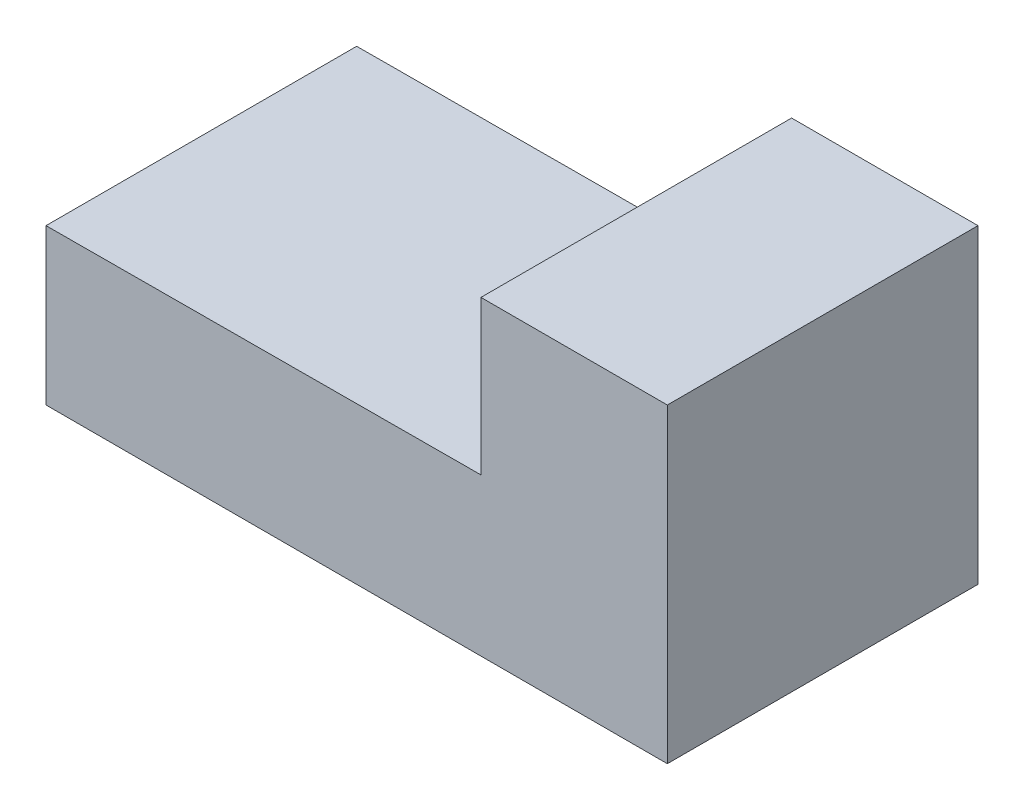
ISO-10303-21;
HEADER;
FILE_DESCRIPTION(('STEP AP214'),'2;1');
FILE_NAME('part.step','',(''),(''),'','','');
FILE_SCHEMA(('AUTOMOTIVE_DESIGN { 1 0 10303 214 1 1 1 1 }'));
ENDSEC;
DATA;
#1=APPLICATION_CONTEXT('core data for automotive mechanical design processes');
#2=APPLICATION_PROTOCOL_DEFINITION('international standard','automotive_design',2000,#1);
#3=PRODUCT_CONTEXT('',#1,'mechanical');
#4=PRODUCT('Part','Part','',(#3));
#5=PRODUCT_RELATED_PRODUCT_CATEGORY('part','',(#4));
#6=PRODUCT_DEFINITION_FORMATION('','',#4);
#7=PRODUCT_DEFINITION_CONTEXT('part definition',#1,'design');
#8=PRODUCT_DEFINITION('design','',#6,#7);
#9=PRODUCT_DEFINITION_SHAPE('','',#8);
#10=(LENGTH_UNIT() NAMED_UNIT(*) SI_UNIT(.MILLI.,.METRE.));
#11=(NAMED_UNIT(*) PLANE_ANGLE_UNIT() SI_UNIT($,.RADIAN.));
#12=(NAMED_UNIT(*) SI_UNIT($,.STERADIAN.) SOLID_ANGLE_UNIT());
#13=UNCERTAINTY_MEASURE_WITH_UNIT(LENGTH_MEASURE(1.E-05),#10,'distance_accuracy_value','');
#14=(GEOMETRIC_REPRESENTATION_CONTEXT(3) GLOBAL_UNCERTAINTY_ASSIGNED_CONTEXT((#13)) GLOBAL_UNIT_ASSIGNED_CONTEXT((#10,
#11,#12)) REPRESENTATION_CONTEXT('',''));
#15=CARTESIAN_POINT('',(0.,0.,0.));
#16=DIRECTION('',(0.,0.,1.));
#17=DIRECTION('',(1.,0.,0.));
#18=AXIS2_PLACEMENT_3D('',#15,#16,#17);
#19=CARTESIAN_POINT('',(42.,0.156250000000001,30.));
#20=DIRECTION('',(0.00372021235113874,-0.999993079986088,0.));
#21=DIRECTION('',(0.999993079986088,0.00372021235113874,0.));
#22=AXIS2_PLACEMENT_3D('',#19,#20,#21);
#23=PLANE('',#22);
#24=DIRECTION('',(-0.999993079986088,-0.00372021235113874,0.));
#25=VECTOR('',#24,1.);
#26=CARTESIAN_POINT('',(42.,0.156250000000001,0.));
#27=LINE('',#26,#25);
#28=CARTESIAN_POINT('',(42.,0.156250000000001,0.));
#29=VERTEX_POINT('',#28);
#30=CARTESIAN_POINT('',(0.,0.,0.));
#31=VERTEX_POINT('',#30);
#32=EDGE_CURVE('E134',#29,#31,#27,.T.);
#33=ORIENTED_EDGE('',*,*,#32,.T.);
#34=DIRECTION('',(0.,0.,-1.));
#35=VECTOR('',#34,1.);
#36=CARTESIAN_POINT('',(0.,0.,30.));
#37=LINE('',#36,#35);
#38=CARTESIAN_POINT('',(0.,0.,30.));
#39=VERTEX_POINT('',#38);
#40=EDGE_CURVE('E11',#39,#31,#37,.T.);
#41=ORIENTED_EDGE('',*,*,#40,.F.);
#42=DIRECTION('',(-0.999993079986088,-0.00372021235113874,0.));
#43=VECTOR('',#42,1.);
#44=CARTESIAN_POINT('',(42.,0.156250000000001,30.));
#45=LINE('',#44,#43);
#46=CARTESIAN_POINT('',(42.,0.156250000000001,30.));
#47=VERTEX_POINT('',#46);
#48=EDGE_CURVE('E150',#47,#39,#45,.T.);
#49=ORIENTED_EDGE('',*,*,#48,.F.);
#50=DIRECTION('',(0.,0.,-1.));
#51=VECTOR('',#50,1.);
#52=CARTESIAN_POINT('',(42.,0.156250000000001,30.));
#53=LINE('',#52,#51);
#54=EDGE_CURVE('E130',#47,#29,#53,.T.);
#55=ORIENTED_EDGE('',*,*,#54,.T.);
#56=EDGE_LOOP('',(#33,#41,#49,#55));
#57=FACE_BOUND('',#56,.T.);
#58=ADVANCED_FACE('F45',(#57),#23,.F.);
#59=CARTESIAN_POINT('',(0.,0.,30.));
#60=DIRECTION('',(1.,0.,0.));
#61=DIRECTION('',(0.,0.,-1.));
#62=AXIS2_PLACEMENT_3D('',#59,#60,#61);
#63=PLANE('',#62);
#64=DIRECTION('',(0.,-1.,0.));
#65=VECTOR('',#64,1.);
#66=CARTESIAN_POINT('',(0.,0.,0.));
#67=LINE('',#66,#65);
#68=CARTESIAN_POINT('',(0.,-15.,0.));
#69=VERTEX_POINT('',#68);
#70=EDGE_CURVE('E138',#31,#69,#67,.T.);
#71=ORIENTED_EDGE('',*,*,#70,.T.);
#72=DIRECTION('',(0.,0.,-1.));
#73=VECTOR('',#72,1.);
#74=CARTESIAN_POINT('',(0.,-15.,30.));
#75=LINE('',#74,#73);
#76=CARTESIAN_POINT('',(0.,-15.,30.));
#77=VERTEX_POINT('',#76);
#78=EDGE_CURVE('E54',#77,#69,#75,.T.);
#79=ORIENTED_EDGE('',*,*,#78,.F.);
#80=DIRECTION('',(0.,-1.,0.));
#81=VECTOR('',#80,1.);
#82=CARTESIAN_POINT('',(0.,0.,30.));
#83=LINE('',#82,#81);
#84=EDGE_CURVE('E99',#39,#77,#83,.T.);
#85=ORIENTED_EDGE('',*,*,#84,.F.);
#86=ORIENTED_EDGE('',*,*,#40,.T.);
#87=EDGE_LOOP('',(#71,#79,#85,#86));
#88=FACE_BOUND('',#87,.T.);
#89=ADVANCED_FACE('F178',(#88),#63,.F.);
#90=CARTESIAN_POINT('',(0.,-15.,30.));
#91=DIRECTION('',(0.,1.,0.));
#92=DIRECTION('',(0.,0.,1.));
#93=AXIS2_PLACEMENT_3D('',#90,#91,#92);
#94=PLANE('',#93);
#95=DIRECTION('',(1.,0.,0.));
#96=VECTOR('',#95,1.);
#97=CARTESIAN_POINT('',(0.,-15.,0.));
#98=LINE('',#97,#96);
#99=CARTESIAN_POINT('',(60.,-15.,0.));
#100=VERTEX_POINT('',#99);
#101=EDGE_CURVE('E141',#69,#100,#98,.T.);
#102=ORIENTED_EDGE('',*,*,#101,.T.);
#103=DIRECTION('',(0.,0.,-1.));
#104=VECTOR('',#103,1.);
#105=CARTESIAN_POINT('',(60.,-15.,30.));
#106=LINE('',#105,#104);
#107=CARTESIAN_POINT('',(60.,-15.,30.));
#108=VERTEX_POINT('',#107);
#109=EDGE_CURVE('E123',#108,#100,#106,.T.);
#110=ORIENTED_EDGE('',*,*,#109,.F.);
#111=DIRECTION('',(1.,0.,0.));
#112=VECTOR('',#111,1.);
#113=CARTESIAN_POINT('',(0.,-15.,30.));
#114=LINE('',#113,#112);
#115=EDGE_CURVE('E112',#77,#108,#114,.T.);
#116=ORIENTED_EDGE('',*,*,#115,.F.);
#117=ORIENTED_EDGE('',*,*,#78,.T.);
#118=EDGE_LOOP('',(#102,#110,#116,#117));
#119=FACE_BOUND('',#118,.T.);
#120=ADVANCED_FACE('F160',(#119),#94,.F.);
#121=CARTESIAN_POINT('',(60.,-15.,30.));
#122=DIRECTION('',(-1.,0.,0.));
#123=DIRECTION('',(0.,0.,1.));
#124=AXIS2_PLACEMENT_3D('',#121,#122,#123);
#125=PLANE('',#124);
#126=DIRECTION('',(0.,1.,0.));
#127=VECTOR('',#126,1.);
#128=CARTESIAN_POINT('',(60.,-15.,0.));
#129=LINE('',#128,#127);
#130=CARTESIAN_POINT('',(60.,15.,0.));
#131=VERTEX_POINT('',#130);
#132=EDGE_CURVE('E121',#100,#131,#129,.T.);
#133=ORIENTED_EDGE('',*,*,#132,.T.);
#134=DIRECTION('',(0.,0.,-1.));
#135=VECTOR('',#134,1.);
#136=CARTESIAN_POINT('',(60.,15.,30.));
#137=LINE('',#136,#135);
#138=CARTESIAN_POINT('',(60.,15.,30.));
#139=VERTEX_POINT('',#138);
#140=EDGE_CURVE('E118',#139,#131,#137,.T.);
#141=ORIENTED_EDGE('',*,*,#140,.F.);
#142=DIRECTION('',(0.,1.,0.));
#143=VECTOR('',#142,1.);
#144=CARTESIAN_POINT('',(60.,-15.,30.));
#145=LINE('',#144,#143);
#146=EDGE_CURVE('E106',#108,#139,#145,.T.);
#147=ORIENTED_EDGE('',*,*,#146,.F.);
#148=ORIENTED_EDGE('',*,*,#109,.T.);
#149=EDGE_LOOP('',(#133,#141,#147,#148));
#150=FACE_BOUND('',#149,.T.);
#151=ADVANCED_FACE('F119',(#150),#125,.F.);
#152=CARTESIAN_POINT('',(60.,15.,30.));
#153=DIRECTION('',(0.,-1.,0.));
#154=DIRECTION('',(1.,0.,0.));
#155=AXIS2_PLACEMENT_3D('',#152,#153,#154);
#156=PLANE('',#155);
#157=DIRECTION('',(-1.,0.,0.));
#158=VECTOR('',#157,1.);
#159=CARTESIAN_POINT('',(60.,15.,0.));
#160=LINE('',#159,#158);
#161=CARTESIAN_POINT('',(42.,15.,0.));
#162=VERTEX_POINT('',#161);
#163=EDGE_CURVE('E85',#131,#162,#160,.T.);
#164=ORIENTED_EDGE('',*,*,#163,.T.);
#165=DIRECTION('',(0.,0.,-1.));
#166=VECTOR('',#165,1.);
#167=CARTESIAN_POINT('',(42.,15.,30.));
#168=LINE('',#167,#166);
#169=CARTESIAN_POINT('',(42.,15.,30.));
#170=VERTEX_POINT('',#169);
#171=EDGE_CURVE('E124',#170,#162,#168,.T.);
#172=ORIENTED_EDGE('',*,*,#171,.F.);
#173=DIRECTION('',(-1.,0.,0.));
#174=VECTOR('',#173,1.);
#175=CARTESIAN_POINT('',(60.,15.,30.));
#176=LINE('',#175,#174);
#177=EDGE_CURVE('E110',#139,#170,#176,.T.);
#178=ORIENTED_EDGE('',*,*,#177,.F.);
#179=ORIENTED_EDGE('',*,*,#140,.T.);
#180=EDGE_LOOP('',(#164,#172,#178,#179));
#181=FACE_BOUND('',#180,.T.);
#182=ADVANCED_FACE('F126',(#181),#156,.F.);
#183=CARTESIAN_POINT('',(42.,15.,30.));
#184=DIRECTION('',(1.,0.,0.));
#185=DIRECTION('',(0.,1.,0.));
#186=AXIS2_PLACEMENT_3D('',#183,#184,#185);
#187=PLANE('',#186);
#188=DIRECTION('',(0.,-1.,0.));
#189=VECTOR('',#188,1.);
#190=CARTESIAN_POINT('',(42.,15.,0.));
#191=LINE('',#190,#189);
#192=EDGE_CURVE('E91',#162,#29,#191,.T.);
#193=ORIENTED_EDGE('',*,*,#192,.T.);
#194=ORIENTED_EDGE('',*,*,#54,.F.);
#195=DIRECTION('',(0.,-1.,0.));
#196=VECTOR('',#195,1.);
#197=CARTESIAN_POINT('',(42.,15.,30.));
#198=LINE('',#197,#196);
#199=EDGE_CURVE('E62',#170,#47,#198,.T.);
#200=ORIENTED_EDGE('',*,*,#199,.F.);
#201=ORIENTED_EDGE('',*,*,#171,.T.);
#202=EDGE_LOOP('',(#193,#194,#200,#201));
#203=FACE_BOUND('',#202,.T.);
#204=ADVANCED_FACE('F167',(#203),#187,.F.);
#205=CARTESIAN_POINT('',(0.,0.,30.));
#206=DIRECTION('',(0.,0.,1.));
#207=DIRECTION('',(1.,0.,0.));
#208=AXIS2_PLACEMENT_3D('',#205,#206,#207);
#209=PLANE('',#208);
#210=ORIENTED_EDGE('',*,*,#48,.T.);
#211=ORIENTED_EDGE('',*,*,#84,.T.);
#212=ORIENTED_EDGE('',*,*,#115,.T.);
#213=ORIENTED_EDGE('',*,*,#146,.T.);
#214=ORIENTED_EDGE('',*,*,#177,.T.);
#215=ORIENTED_EDGE('',*,*,#199,.T.);
#216=EDGE_LOOP('',(#210,#211,#212,#213,#214,#215));
#217=FACE_BOUND('',#216,.T.);
#218=ADVANCED_FACE('F108',(#217),#209,.T.);
#219=CARTESIAN_POINT('',(0.,0.,0.));
#220=DIRECTION('',(0.,0.,1.));
#221=DIRECTION('',(1.,0.,0.));
#222=AXIS2_PLACEMENT_3D('',#219,#220,#221);
#223=PLANE('',#222);
#224=ORIENTED_EDGE('',*,*,#32,.F.);
#225=ORIENTED_EDGE('',*,*,#192,.F.);
#226=ORIENTED_EDGE('',*,*,#163,.F.);
#227=ORIENTED_EDGE('',*,*,#132,.F.);
#228=ORIENTED_EDGE('',*,*,#101,.F.);
#229=ORIENTED_EDGE('',*,*,#70,.F.);
#230=EDGE_LOOP('',(#224,#225,#226,#227,#228,#229));
#231=FACE_BOUND('',#230,.T.);
#232=ADVANCED_FACE('F163',(#231),#223,.F.);
#233=CLOSED_SHELL('',(#58,#89,#120,#151,#182,#204,#218,#232));
#234=MANIFOLD_SOLID_BREP('B2',#233);
#235=ADVANCED_BREP_SHAPE_REPRESENTATION('',(#18,#234),#14);
#236=SHAPE_DEFINITION_REPRESENTATION(#9,#235);
ENDSEC;
END-ISO-10303-21;
